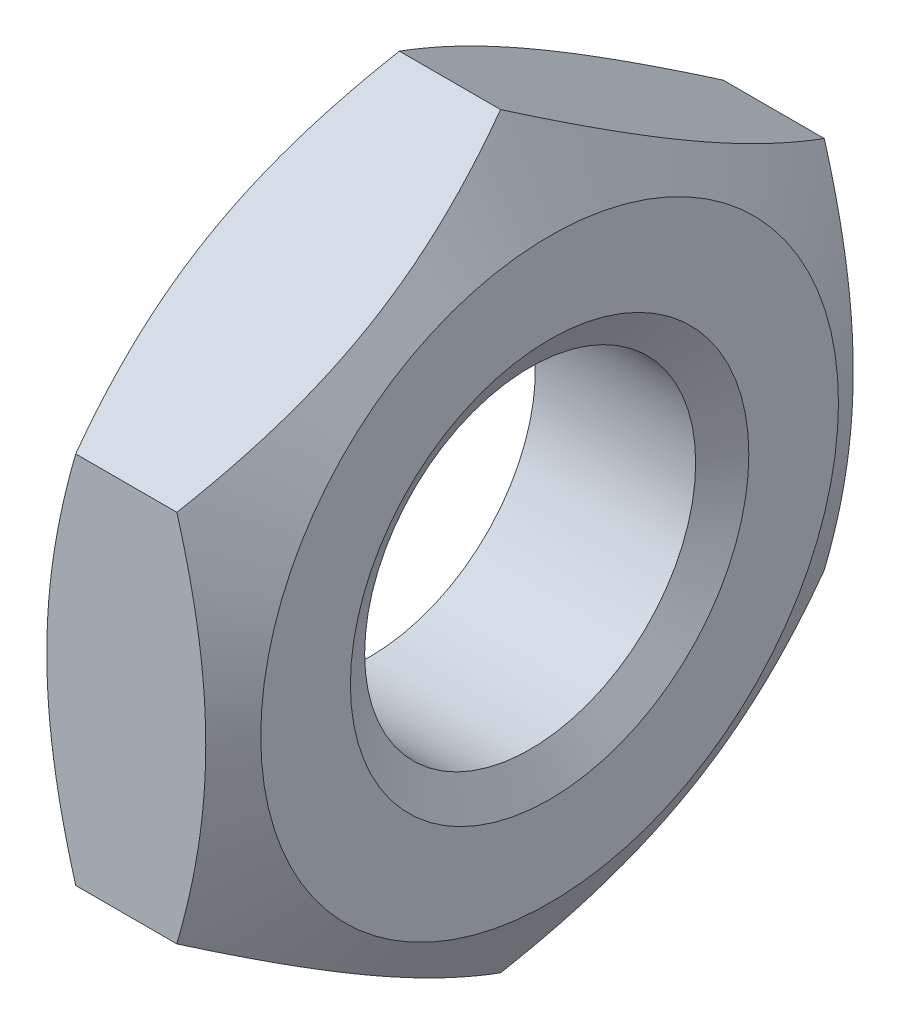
ISO-10303-21;
HEADER;
FILE_DESCRIPTION(('STEP AP214'),'2;1');
FILE_NAME('part.step','',(''),(''),'','','');
FILE_SCHEMA(('AUTOMOTIVE_DESIGN { 1 0 10303 214 1 1 1 1 }'));
ENDSEC;
DATA;
#1=APPLICATION_CONTEXT('core data for automotive mechanical design processes');
#2=APPLICATION_PROTOCOL_DEFINITION('international standard','automotive_design',2000,#1);
#3=PRODUCT_CONTEXT('',#1,'mechanical');
#4=PRODUCT('Part','Part','',(#3));
#5=PRODUCT_RELATED_PRODUCT_CATEGORY('part','',(#4));
#6=PRODUCT_DEFINITION_FORMATION('','',#4);
#7=PRODUCT_DEFINITION_CONTEXT('part definition',#1,'design');
#8=PRODUCT_DEFINITION('design','',#6,#7);
#9=PRODUCT_DEFINITION_SHAPE('','',#8);
#10=(LENGTH_UNIT() NAMED_UNIT(*) SI_UNIT(.MILLI.,.METRE.));
#11=(NAMED_UNIT(*) PLANE_ANGLE_UNIT() SI_UNIT($,.RADIAN.));
#12=(NAMED_UNIT(*) SI_UNIT($,.STERADIAN.) SOLID_ANGLE_UNIT());
#13=UNCERTAINTY_MEASURE_WITH_UNIT(LENGTH_MEASURE(1.E-05),#10,'distance_accuracy_value','');
#14=(GEOMETRIC_REPRESENTATION_CONTEXT(3) GLOBAL_UNCERTAINTY_ASSIGNED_CONTEXT((#13)) GLOBAL_UNIT_ASSIGNED_CONTEXT((#10,
#11,#12)) REPRESENTATION_CONTEXT('',''));
#15=CARTESIAN_POINT('',(0.,0.,0.));
#16=DIRECTION('',(0.,0.,1.));
#17=DIRECTION('',(1.,0.,0.));
#18=AXIS2_PLACEMENT_3D('',#15,#16,#17);
#19=CARTESIAN_POINT('',(0.,-3.75277674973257,6.5));
#20=DIRECTION('',(0.,0.,1.));
#21=DIRECTION('',(1.,0.,0.));
#22=AXIS2_PLACEMENT_3D('',#19,#20,#21);
#23=PLANE('',#22);
#24=CARTESIAN_POINT('',(3.01529819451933,3.75277677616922,6.49999996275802));
#25=CARTESIAN_POINT('',(3.06291428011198,3.58779804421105,6.49999998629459));
#26=CARTESIAN_POINT('',(3.10836918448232,3.42220419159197,6.49999999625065));
#27=CARTESIAN_POINT('',(3.19436143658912,3.08967170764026,6.50000000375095));
#28=CARTESIAN_POINT('',(3.2348966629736,2.92273252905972,6.50000000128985));
#29=CARTESIAN_POINT('',(3.3483271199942,2.41924227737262,6.49999999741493));
#30=CARTESIAN_POINT('',(3.41284405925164,2.08070382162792,6.49999999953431));
#31=CARTESIAN_POINT('',(3.48849596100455,1.57408722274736,6.50000000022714));
#32=CARTESIAN_POINT('',(3.51004663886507,1.40752264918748,6.50000000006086));
#33=CARTESIAN_POINT('',(3.54618311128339,1.07364098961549,6.49999999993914));
#34=CARTESIAN_POINT('',(3.56076952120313,0.906323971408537,6.49999999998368));
#35=CARTESIAN_POINT('',(3.58260571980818,0.571399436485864,6.5000000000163));
#36=CARTESIAN_POINT('',(3.58986383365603,0.403792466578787,6.50000000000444));
#37=CARTESIAN_POINT('',(3.59689560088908,0.0684330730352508,6.49999999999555));
#38=CARTESIAN_POINT('',(3.59666948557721,-0.0993193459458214,6.49999999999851));
#39=CARTESIAN_POINT('',(3.58576325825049,-0.558877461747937,6.50000000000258));
#40=CARTESIAN_POINT('',(3.56746378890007,-0.850532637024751,6.50000000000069));
#41=CARTESIAN_POINT('',(3.50944227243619,-1.43190589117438,6.4999999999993));
#42=CARTESIAN_POINT('',(3.46970040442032,-1.72162192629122,6.4999999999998));
#43=CARTESIAN_POINT('',(3.37035972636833,-2.30416466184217,6.5000000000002));
#44=CARTESIAN_POINT('',(3.31034012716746,-2.59691787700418,6.5000000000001));
#45=CARTESIAN_POINT('',(3.17412079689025,-3.1780591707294,6.4999999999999));
#46=CARTESIAN_POINT('',(3.09795305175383,-3.46645468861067,6.49999999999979));
#47=CARTESIAN_POINT('',(3.01529825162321,-3.75277666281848,6.5));
#48=B_SPLINE_CURVE_WITH_KNOTS('',3,(#24,#25,#26,#27,#28,#29,#30,#31,#32,#33,#34,#35,#36,#37,#38,
#39,#40,#41,#42,#43,#44,#45,#46,#47),.UNSPECIFIED.,.F.,.F.,(4,2,2,2,2,2,2,2,2,2,2,4),(0.,
0.515097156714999,1.03041563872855,2.06319351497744,2.56693471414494,3.07063139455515,
3.57375521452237,4.07686348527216,4.95263086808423,5.82920918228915,6.72522580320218,
7.61948392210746),.UNSPECIFIED.);
#49=CARTESIAN_POINT('',(3.01529823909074,3.75277677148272,6.49999996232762));
#50=VERTEX_POINT('',#49);
#51=CARTESIAN_POINT('',(3.01529823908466,-3.75277670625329,6.5));
#52=VERTEX_POINT('',#51);
#53=EDGE_CURVE('E92',#50,#52,#48,.T.);
#54=ORIENTED_EDGE('',*,*,#53,.F.);
#55=DIRECTION('',(1.,0.,0.));
#56=VECTOR('',#55,1.);
#57=CARTESIAN_POINT('',(0.,3.75277674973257,6.5));
#58=LINE('',#57,#56);
#59=CARTESIAN_POINT('',(0.984701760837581,3.75277670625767,6.5));
#60=VERTEX_POINT('',#59);
#61=EDGE_CURVE('E80',#60,#50,#58,.T.);
#62=ORIENTED_EDGE('',*,*,#61,.F.);
#63=CARTESIAN_POINT('',(0.984701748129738,-3.75277666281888,6.50000000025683));
#64=CARTESIAN_POINT('',(0.937085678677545,-3.58779792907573,6.50000000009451));
#65=CARTESIAN_POINT('',(0.891630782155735,-3.42220407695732,6.50000000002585));
#66=CARTESIAN_POINT('',(0.805638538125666,-3.08967159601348,6.49999999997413));
#67=CARTESIAN_POINT('',(0.765103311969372,-2.92273241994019,6.4999999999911));
#68=CARTESIAN_POINT('',(0.651672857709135,-2.41924217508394,6.50000000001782));
#69=CARTESIAN_POINT('',(0.587155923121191,-2.08070372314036,6.50000000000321));
#70=CARTESIAN_POINT('',(0.511504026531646,-1.57408713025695,6.49999999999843));
#71=CARTESIAN_POINT('',(0.489953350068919,-1.40752255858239,6.49999999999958));
#72=CARTESIAN_POINT('',(0.453816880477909,-1.07364090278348,6.50000000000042));
#73=CARTESIAN_POINT('',(0.439230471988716,-0.906323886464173,6.50000000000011));
#74=CARTESIAN_POINT('',(0.41739427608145,-0.57139935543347,6.49999999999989));
#75=CARTESIAN_POINT('',(0.410136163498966,-0.40379238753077,6.49999999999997));
#76=CARTESIAN_POINT('',(0.403104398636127,-0.068432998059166,6.50000000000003));
#77=CARTESIAN_POINT('',(0.403330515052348,0.0993194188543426,6.50000000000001));
#78=CARTESIAN_POINT('',(0.414236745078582,0.558877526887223,6.49999999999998));
#79=CARTESIAN_POINT('',(0.432536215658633,0.850532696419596,6.49999999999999));
#80=CARTESIAN_POINT('',(0.490557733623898,1.43190593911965,6.5));
#81=CARTESIAN_POINT('',(0.530299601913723,1.72162196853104,6.5));
#82=CARTESIAN_POINT('',(0.629640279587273,2.30416469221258,6.5));
#83=CARTESIAN_POINT('',(0.689659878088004,2.59691790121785,6.5));
#84=CARTESIAN_POINT('',(0.825879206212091,3.17805918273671,6.5));
#85=CARTESIAN_POINT('',(0.902046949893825,3.4664546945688,6.5));
#86=CARTESIAN_POINT('',(0.984701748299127,3.75277666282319,6.5));
#87=B_SPLINE_CURVE_WITH_KNOTS('',3,(#63,#64,#65,#66,#67,#68,#69,#70,#71,#72,#73,#74,#75,#76,#77,
#78,#79,#80,#81,#82,#83,#84,#85,#86),.UNSPECIFIED.,.F.,.F.,(4,2,2,2,2,2,2,2,2,2,2,4),(0.,
0.515097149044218,1.03041562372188,2.06319348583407,2.56693467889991,3.07063135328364,
3.57375516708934,4.0768634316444,4.95263079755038,5.82920909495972,6.72522569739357,
7.61948379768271),.UNSPECIFIED.);
#88=CARTESIAN_POINT('',(0.984701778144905,-3.75277674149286,6.5000000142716));
#89=VERTEX_POINT('',#88);
#90=EDGE_CURVE('E116',#89,#60,#87,.T.);
#91=ORIENTED_EDGE('',*,*,#90,.F.);
#92=DIRECTION('',(1.,0.,0.));
#93=VECTOR('',#92,1.);
#94=CARTESIAN_POINT('',(0.,-3.75277674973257,6.5));
#95=LINE('',#94,#93);
#96=EDGE_CURVE('E95',#52,#89,#95,.F.);
#97=ORIENTED_EDGE('',*,*,#96,.F.);
#98=EDGE_LOOP('',(#54,#62,#91,#97));
#99=FACE_BOUND('',#98,.T.);
#100=ADVANCED_FACE('F16',(#99),#23,.T.);
#101=CARTESIAN_POINT('',(0.,3.75277674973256,6.5));
#102=DIRECTION('',(0.,0.866025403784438,0.500000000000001));
#103=DIRECTION('',(0.,-0.500000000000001,0.866025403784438));
#104=AXIS2_PLACEMENT_3D('',#101,#102,#103);
#105=PLANE('',#104);
#106=CARTESIAN_POINT('',(3.01529825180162,7.50555345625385,7.5398923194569E-08));
#107=CARTESIAN_POINT('',(3.06291432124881,7.42306408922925,0.142875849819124));
#108=CARTESIAN_POINT('',(3.10836921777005,7.3402671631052,0.286284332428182));
#109=CARTESIAN_POINT('',(3.1943614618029,7.17400092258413,0.574265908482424));
#110=CARTESIAN_POINT('',(3.23489668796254,7.0905313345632,0.718839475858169));
#111=CARTESIAN_POINT('',(3.34832714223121,6.8387862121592,1.15487481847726));
#112=CARTESIAN_POINT('',(3.41284407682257,6.66951698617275,1.44805771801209));
#113=CARTESIAN_POINT('',(3.48849597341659,6.41620868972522,1.8868005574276));
#114=CARTESIAN_POINT('',(3.51004664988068,6.33292640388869,2.03104970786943));
#115=CARTESIAN_POINT('',(3.54618311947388,6.1659855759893,2.32019970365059));
#116=CARTESIAN_POINT('',(3.56076952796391,6.08232706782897,2.46510049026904));
#117=CARTESIAN_POINT('',(3.58260572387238,5.91486480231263,2.75515364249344));
#118=CARTESIAN_POINT('',(3.58986383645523,5.83106131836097,2.90030553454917));
#119=CARTESIAN_POINT('',(3.59689560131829,5.66338162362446,3.19073528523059));
#120=CARTESIAN_POINT('',(3.59666948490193,5.57950541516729,3.33601313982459));
#121=CARTESIAN_POINT('',(3.58576325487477,5.3497263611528,3.73400213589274));
#122=CARTESIAN_POINT('',(3.56746378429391,5.20389877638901,3.98658292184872));
#123=CARTESIAN_POINT('',(3.50944226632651,4.9132121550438,4.49006691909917));
#124=CARTESIAN_POINT('',(3.46970039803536,4.76835414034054,4.74096836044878));
#125=CARTESIAN_POINT('',(3.37035972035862,4.47708277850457,5.24546515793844));
#126=CARTESIAN_POINT('',(3.31034012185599,4.33070617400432,5.4989968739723));
#127=CARTESIAN_POINT('',(3.17412079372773,4.04013553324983,6.00227998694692));
#128=CARTESIAN_POINT('',(3.09795305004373,3.89593777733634,6.25203782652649));
#129=CARTESIAN_POINT('',(3.01529825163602,3.75277679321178,6.49999992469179));
#130=B_SPLINE_CURVE_WITH_KNOTS('',3,(#106,#107,#108,#109,#110,#111,#112,#113,#114,#115,#116,
#117,#118,#119,#120,#121,#122,#123,#124,#125,#126,#127,#128,#129),.UNSPECIFIED.,.F.,.F.,(4,2,2,
2,2,2,2,2,2,2,2,4),(0.,0.515097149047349,1.03041562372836,2.06319348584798,2.56693467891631,
3.07063135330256,3.57375516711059,4.07686343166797,4.95263079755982,5.82920909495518,
6.72522569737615,7.61948379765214),.UNSPECIFIED.);
#131=CARTESIAN_POINT('',(3.01529822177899,7.50555350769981,1.42628728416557E-08));
#132=VERTEX_POINT('',#131);
#133=EDGE_CURVE('E20',#132,#50,#130,.T.);
#134=ORIENTED_EDGE('',*,*,#133,.F.);
#135=DIRECTION('',(1.,0.,0.));
#136=VECTOR('',#135,1.);
#137=CARTESIAN_POINT('',(0.,7.50555349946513,0.));
#138=LINE('',#137,#136);
#139=CARTESIAN_POINT('',(0.984701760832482,7.50555347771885,3.76656758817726E-08));
#140=VERTEX_POINT('',#139);
#141=EDGE_CURVE('E73',#140,#132,#138,.T.);
#142=ORIENTED_EDGE('',*,*,#141,.F.);
#143=CARTESIAN_POINT('',(0.984701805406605,3.75277670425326,6.50000000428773));
#144=CARTESIAN_POINT('',(0.937085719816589,3.83526609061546,6.35712424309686));
#145=CARTESIAN_POINT('',(0.891630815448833,3.9180630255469,6.21371576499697));
#146=CARTESIAN_POINT('',(0.805638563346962,4.08432927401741,5.92573419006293));
#147=CARTESIAN_POINT('',(0.765103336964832,4.16779886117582,5.78116061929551));
#148=CARTESIAN_POINT('',(0.651672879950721,4.41954398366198,5.34512526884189));
#149=CARTESIAN_POINT('',(0.587155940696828,4.58881321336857,5.05194236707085));
#150=CARTESIAN_POINT('',(0.511504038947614,4.84212151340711,4.61319952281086));
#151=CARTESIAN_POINT('',(0.489953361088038,4.92540380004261,4.46895037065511));
#152=CARTESIAN_POINT('',(0.453816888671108,5.09234462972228,4.17980037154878));
#153=CARTESIAN_POINT('',(0.439230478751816,5.17600313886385,4.03489958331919));
#154=CARTESIAN_POINT('',(0.417394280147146,5.34346540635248,3.74484642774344));
#155=CARTESIAN_POINT('',(0.410136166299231,5.42726889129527,3.59969453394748));
#156=CARTESIAN_POINT('',(0.403104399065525,5.59494858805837,3.30926477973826));
#157=CARTESIAN_POINT('',(0.403330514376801,5.67882479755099,3.16398692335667));
#158=CARTESIAN_POINT('',(0.414236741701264,5.9086038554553,2.76599792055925));
#159=CARTESIAN_POINT('',(0.43253621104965,6.05443144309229,2.51341712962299));
#160=CARTESIAN_POINT('',(0.490557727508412,6.34511807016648,2.00993312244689));
#161=CARTESIAN_POINT('',(0.530299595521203,6.48997608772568,1.75903167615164));
#162=CARTESIAN_POINT('',(0.629640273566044,6.78124745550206,1.25453486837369));
#163=CARTESIAN_POINT('',(0.689659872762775,6.92762406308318,1.0010031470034));
#164=CARTESIAN_POINT('',(0.825879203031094,7.21819470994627,0.497720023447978));
#165=CARTESIAN_POINT('',(0.902046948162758,7.36239246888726,0.247962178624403));
#166=CARTESIAN_POINT('',(0.984701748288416,7.50555345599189,7.52978797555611E-08));
#167=B_SPLINE_CURVE_WITH_KNOTS('',3,(#143,#144,#145,#146,#147,#148,#149,#150,#151,#152,#153,
#154,#155,#156,#157,#158,#159,#160,#161,#162,#163,#164,#165,#166),.UNSPECIFIED.,.F.,.F.,(4,2,2,
2,2,2,2,2,2,2,2,4),(0.,0.515097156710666,1.03041563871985,2.06319351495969,2.56693471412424,
3.07063139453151,3.57375521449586,4.07686348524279,4.95263086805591,5.82920918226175,
6.72522580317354,7.61948392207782),.UNSPECIFIED.);
#168=EDGE_CURVE('E83',#60,#140,#167,.T.);
#169=ORIENTED_EDGE('',*,*,#168,.F.);
#170=ORIENTED_EDGE('',*,*,#61,.T.);
#171=EDGE_LOOP('',(#134,#142,#169,#170));
#172=FACE_BOUND('',#171,.T.);
#173=ADVANCED_FACE('F82',(#172),#105,.T.);
#174=CARTESIAN_POINT('',(0.,7.50555349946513,0.));
#175=DIRECTION('',(0.,0.866025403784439,-0.499999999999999));
#176=DIRECTION('',(0.,0.499999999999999,0.866025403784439));
#177=AXIS2_PLACEMENT_3D('',#174,#175,#176);
#178=PLANE('',#177);
#179=CARTESIAN_POINT('',(3.01529819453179,3.75277670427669,-6.50000000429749));
#180=CARTESIAN_POINT('',(3.06291428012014,3.83526609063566,-6.3571242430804));
#181=CARTESIAN_POINT('',(3.10836918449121,3.91806302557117,-6.21371576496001));
#182=CARTESIAN_POINT('',(3.1943614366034,4.08432927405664,-5.92573418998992));
#183=CARTESIAN_POINT('',(3.23489666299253,4.16779886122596,-5.78116061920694));
#184=CARTESIAN_POINT('',(3.34832712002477,4.41954398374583,-5.34512526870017));
#185=CARTESIAN_POINT('',(3.41284405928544,4.58881321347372,-5.05194236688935));
#186=CARTESIAN_POINT('',(3.48849596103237,4.84212151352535,-4.61319952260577));
#187=CARTESIAN_POINT('',(3.5100466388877,4.92540380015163,-4.46895037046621));
#188=CARTESIAN_POINT('',(3.54618311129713,5.09234462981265,-4.17980037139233));
#189=CARTESIAN_POINT('',(3.56076952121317,5.17600313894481,-4.03489958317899));
#190=CARTESIAN_POINT('',(3.5826057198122,5.34346540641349,-3.74484642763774));
#191=CARTESIAN_POINT('',(3.58986383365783,5.42726889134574,-3.59969453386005));
#192=CARTESIAN_POINT('',(3.59689560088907,5.59494858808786,-3.30926477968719));
#193=CARTESIAN_POINT('',(3.59666948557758,5.67882479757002,-3.16398692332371));
#194=CARTESIAN_POINT('',(3.58576325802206,5.90860386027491,-2.76599791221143));
#195=CARTESIAN_POINT('',(3.56746378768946,6.05443145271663,-2.51341711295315));
#196=CARTESIAN_POINT('',(3.50944226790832,6.34511808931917,-2.00993308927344));
#197=CARTESIAN_POINT('',(3.46970039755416,6.48997611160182,-1.75903163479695));
#198=CARTESIAN_POINT('',(3.37035971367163,6.78124748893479,-1.25453481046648));
#199=CARTESIAN_POINT('',(3.3103401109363,6.92762410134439,-1.00100308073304));
#200=CARTESIAN_POINT('',(3.1741207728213,7.21819475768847,-0.497719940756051));
#201=CARTESIAN_POINT('',(3.09795302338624,7.36239252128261,-0.247962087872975));
#202=CARTESIAN_POINT('',(3.01529821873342,7.50555351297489,2.33995777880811E-08));
#203=B_SPLINE_CURVE_WITH_KNOTS('',3,(#179,#180,#181,#182,#183,#184,#185,#186,#187,#188,#189,
#190,#191,#192,#193,#194,#195,#196,#197,#198,#199,#200,#201,#202),.UNSPECIFIED.,.F.,.F.,(4,2,2,
2,2,2,2,2,2,2,2,4),(0.,0.515097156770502,1.03041563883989,2.06319351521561,2.56693471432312,
3.07063139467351,3.57375521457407,4.07686348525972,4.95263089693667,5.82920924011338,
6.7252258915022,7.61948404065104),.UNSPECIFIED.);
#204=CARTESIAN_POINT('',(3.01529823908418,3.75277670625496,-6.5));
#205=VERTEX_POINT('',#204);
#206=EDGE_CURVE('E94',#205,#132,#203,.T.);
#207=ORIENTED_EDGE('',*,*,#206,.F.);
#208=DIRECTION('',(-1.,0.,0.));
#209=VECTOR('',#208,1.);
#210=CARTESIAN_POINT('',(0.,3.75277674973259,-6.5));
#211=LINE('',#210,#209);
#212=CARTESIAN_POINT('',(0.98470176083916,3.75277677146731,-6.49999996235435));
#213=VERTEX_POINT('',#212);
#214=EDGE_CURVE('E189',#213,#205,#211,.F.);
#215=ORIENTED_EDGE('',*,*,#214,.F.);
#216=CARTESIAN_POINT('',(0.984701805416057,7.50555348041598,4.15297828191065E-08));
#217=CARTESIAN_POINT('',(0.937085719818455,7.42306413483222,-0.142875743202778));
#218=CARTESIAN_POINT('',(0.891630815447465,7.34026721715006,-0.28628423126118));
#219=CARTESIAN_POINT('',(0.805638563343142,7.1740009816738,-0.574265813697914));
#220=CARTESIAN_POINT('',(0.765103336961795,7.09053139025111,-0.718839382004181));
#221=CARTESIAN_POINT('',(0.651672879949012,6.83878626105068,-1.15487472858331));
#222=CARTESIAN_POINT('',(0.587155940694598,6.66951703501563,-1.44805763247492));
#223=CARTESIAN_POINT('',(0.511504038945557,6.41620873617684,-1.88680047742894));
#224=CARTESIAN_POINT('',(0.489953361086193,6.33292644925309,-2.03104962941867));
#225=CARTESIAN_POINT('',(0.45381688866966,6.16598561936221,-2.32019962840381));
#226=CARTESIAN_POINT('',(0.439230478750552,6.08232711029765,-2.46510041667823));
#227=CARTESIAN_POINT('',(0.4173942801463,5.91486484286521,-2.75515357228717));
#228=CARTESIAN_POINT('',(0.410136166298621,5.83106135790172,-2.90030546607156));
#229=CARTESIAN_POINT('',(0.403104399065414,5.66338166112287,-3.19073522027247));
#230=CARTESIAN_POINT('',(0.403330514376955,5.57950545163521,-3.33601307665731));
#231=CARTESIAN_POINT('',(0.414236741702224,5.34972639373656,-3.73400207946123));
#232=CARTESIAN_POINT('',(0.432536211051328,5.20389880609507,-3.98658287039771));
#233=CARTESIAN_POINT('',(0.490557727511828,4.91321217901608,-4.49006687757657));
#234=CARTESIAN_POINT('',(0.530299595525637,4.76835416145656,-4.74096832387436));
#235=CARTESIAN_POINT('',(0.629640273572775,4.47708279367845,-5.24546513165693));
#236=CARTESIAN_POINT('',(0.689659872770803,4.3307061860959,-5.49899685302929));
#237=CARTESIAN_POINT('',(0.825879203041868,4.04013553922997,-6.00227997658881));
#238=CARTESIAN_POINT('',(0.902046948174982,3.89593778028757,-6.25203782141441));
#239=CARTESIAN_POINT('',(0.98470174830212,3.75277679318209,-6.49999992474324));
#240=B_SPLINE_CURVE_WITH_KNOTS('',3,(#216,#217,#218,#219,#220,#221,#222,#223,#224,#225,#226,
#227,#228,#229,#230,#231,#232,#233,#234,#235,#236,#237,#238,#239),.UNSPECIFIED.,.F.,.F.,(4,2,2,
2,2,2,2,2,2,2,2,4),(0.,0.515097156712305,1.03041563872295,2.06319351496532,2.5669347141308,
3.07063139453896,3.57375521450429,4.07686348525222,4.95263086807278,5.829209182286,
6.72522580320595,7.61948392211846),.UNSPECIFIED.);
#241=EDGE_CURVE('E159',#140,#213,#240,.T.);
#242=ORIENTED_EDGE('',*,*,#241,.F.);
#243=ORIENTED_EDGE('',*,*,#141,.T.);
#244=EDGE_LOOP('',(#207,#215,#242,#243));
#245=FACE_BOUND('',#244,.T.);
#246=ADVANCED_FACE('F163',(#245),#178,.T.);
#247=CARTESIAN_POINT('',(0.,3.75277674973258,-6.5));
#248=DIRECTION('',(0.,0.,-1.));
#249=DIRECTION('',(-1.,0.,0.));
#250=AXIS2_PLACEMENT_3D('',#247,#248,#249);
#251=PLANE('',#250);
#252=CARTESIAN_POINT('',(3.01529819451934,-3.7527767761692,-6.49999996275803));
#253=CARTESIAN_POINT('',(3.06291428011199,-3.58779804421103,-6.4999999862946));
#254=CARTESIAN_POINT('',(3.10836918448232,-3.42220419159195,-6.49999999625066));
#255=CARTESIAN_POINT('',(3.19436143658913,-3.08967170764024,-6.50000000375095));
#256=CARTESIAN_POINT('',(3.23489666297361,-2.92273252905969,-6.50000000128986));
#257=CARTESIAN_POINT('',(3.34832711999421,-2.4192422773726,-6.49999999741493));
#258=CARTESIAN_POINT('',(3.41284405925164,-2.0807038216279,-6.49999999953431));
#259=CARTESIAN_POINT('',(3.48849596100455,-1.57408722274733,-6.50000000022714));
#260=CARTESIAN_POINT('',(3.51004663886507,-1.40752264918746,-6.50000000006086));
#261=CARTESIAN_POINT('',(3.54618311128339,-1.07364098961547,-6.49999999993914));
#262=CARTESIAN_POINT('',(3.56076952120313,-0.906323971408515,-6.49999999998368));
#263=CARTESIAN_POINT('',(3.58260571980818,-0.571399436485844,-6.5000000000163));
#264=CARTESIAN_POINT('',(3.58986383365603,-0.403792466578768,-6.50000000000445));
#265=CARTESIAN_POINT('',(3.59689560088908,-0.0684330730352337,-6.49999999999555));
#266=CARTESIAN_POINT('',(3.59666948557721,0.0993193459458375,-6.49999999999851));
#267=CARTESIAN_POINT('',(3.58576325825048,0.558877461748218,-6.50000000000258));
#268=CARTESIAN_POINT('',(3.56746378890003,0.850532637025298,-6.5000000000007));
#269=CARTESIAN_POINT('',(3.50944227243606,1.43190589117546,-6.4999999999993));
#270=CARTESIAN_POINT('',(3.46970040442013,1.72162192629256,-6.4999999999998));
#271=CARTESIAN_POINT('',(3.37035972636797,2.30416466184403,-6.5000000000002));
#272=CARTESIAN_POINT('',(3.31034012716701,2.59691787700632,-6.5000000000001));
#273=CARTESIAN_POINT('',(3.17412079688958,3.17805917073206,-6.4999999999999));
#274=CARTESIAN_POINT('',(3.09795305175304,3.46645468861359,-6.49999999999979));
#275=CARTESIAN_POINT('',(3.0152982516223,3.75277666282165,-6.5));
#276=B_SPLINE_CURVE_WITH_KNOTS('',3,(#252,#253,#254,#255,#256,#257,#258,#259,#260,#261,#262,
#263,#264,#265,#266,#267,#268,#269,#270,#271,#272,#273,#274,#275),.UNSPECIFIED.,.F.,.F.,(4,2,2,
2,2,2,2,2,2,2,2,4),(0.,0.515097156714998,1.03041563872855,2.06319351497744,2.56693471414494,
3.07063139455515,3.57375521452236,4.07686348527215,4.95263086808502,5.82920918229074,
6.72522580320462,7.61948392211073),.UNSPECIFIED.);
#277=CARTESIAN_POINT('',(3.01529823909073,-3.7527767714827,-6.49999996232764));
#278=VERTEX_POINT('',#277);
#279=EDGE_CURVE('E174',#278,#205,#276,.T.);
#280=ORIENTED_EDGE('',*,*,#279,.F.);
#281=DIRECTION('',(1.,0.,0.));
#282=VECTOR('',#281,1.);
#283=CARTESIAN_POINT('',(0.,-3.75277674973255,-6.50000000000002));
#284=LINE('',#283,#282);
#285=CARTESIAN_POINT('',(0.984701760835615,-3.75277670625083,-6.50000000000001));
#286=VERTEX_POINT('',#285);
#287=EDGE_CURVE('E187',#286,#278,#284,.T.);
#288=ORIENTED_EDGE('',*,*,#287,.F.);
#289=CARTESIAN_POINT('',(0.984701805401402,3.7527767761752,-6.49999996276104));
#290=CARTESIAN_POINT('',(0.937085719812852,3.58779804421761,-6.4999999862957));
#291=CARTESIAN_POINT('',(0.891630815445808,3.42220419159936,-6.49999999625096));
#292=CARTESIAN_POINT('',(0.805638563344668,3.08967170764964,-6.50000000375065));
#293=CARTESIAN_POINT('',(0.765103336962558,2.92273252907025,-6.50000000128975));
#294=CARTESIAN_POINT('',(0.651672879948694,2.41924227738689,-6.49999999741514));
#295=CARTESIAN_POINT('',(0.587155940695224,2.08070382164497,-6.49999999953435));
#296=CARTESIAN_POINT('',(0.51150403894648,1.57408722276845,-6.50000000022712));
#297=CARTESIAN_POINT('',(0.489953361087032,1.40752264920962,-6.50000000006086));
#298=CARTESIAN_POINT('',(0.45381688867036,1.07364098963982,-6.49999999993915));
#299=CARTESIAN_POINT('',(0.439230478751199,0.90632397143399,-6.49999999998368));
#300=CARTESIAN_POINT('',(0.417394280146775,0.571399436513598,-6.5000000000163));
#301=CARTESIAN_POINT('',(0.410136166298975,0.403792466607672,-6.50000000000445));
#302=CARTESIAN_POINT('',(0.403104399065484,0.0684330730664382,-6.49999999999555));
#303=CARTESIAN_POINT('',(0.403330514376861,-0.099319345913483,-6.49999999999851));
#304=CARTESIAN_POINT('',(0.414236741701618,-0.558877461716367,-6.50000000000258));
#305=CARTESIAN_POINT('',(0.432536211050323,-0.850532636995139,-6.5000000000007));
#306=CARTESIAN_POINT('',(0.490557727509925,-1.43190589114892,-6.4999999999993));
#307=CARTESIAN_POINT('',(0.530299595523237,-1.72162192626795,-6.4999999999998));
#308=CARTESIAN_POINT('',(0.629640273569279,-2.30416466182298,-6.5000000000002));
#309=CARTESIAN_POINT('',(0.689659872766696,-2.59691787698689,-6.5000000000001));
#310=CARTESIAN_POINT('',(0.82587920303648,-3.17805917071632,-6.4999999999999));
#311=CARTESIAN_POINT('',(0.902046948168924,-3.46645468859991,-6.49999999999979));
#312=CARTESIAN_POINT('',(0.984701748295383,-3.75277666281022,-6.5));
#313=B_SPLINE_CURVE_WITH_KNOTS('',3,(#289,#290,#291,#292,#293,#294,#295,#296,#297,#298,#299,
#300,#301,#302,#303,#304,#305,#306,#307,#308,#309,#310,#311,#312),.UNSPECIFIED.,.F.,.F.,(4,2,2,
2,2,2,2,2,2,2,2,4),(0.,0.515097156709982,1.03041563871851,2.0631935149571,2.56693471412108,
3.07063139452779,3.57375521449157,4.07686348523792,4.95263086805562,5.82920918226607,
6.72522580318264,7.61948392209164),.UNSPECIFIED.);
#314=EDGE_CURVE('E154',#213,#286,#313,.T.);
#315=ORIENTED_EDGE('',*,*,#314,.F.);
#316=ORIENTED_EDGE('',*,*,#214,.T.);
#317=EDGE_LOOP('',(#280,#288,#315,#316));
#318=FACE_BOUND('',#317,.T.);
#319=ADVANCED_FACE('F166',(#318),#251,.T.);
#320=CARTESIAN_POINT('',(0.,-3.75277674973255,-6.50000000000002));
#321=DIRECTION('',(0.,-0.866025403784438,-0.500000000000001));
#322=DIRECTION('',(0.,0.500000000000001,-0.866025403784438));
#323=AXIS2_PLACEMENT_3D('',#320,#321,#322);
#324=PLANE('',#323);
#325=CARTESIAN_POINT('',(3.01529819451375,-7.50555348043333,4.15271976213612E-08));
#326=CARTESIAN_POINT('',(3.06291428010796,-7.4230641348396,-0.142875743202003));
#327=CARTESIAN_POINT('',(3.10836918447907,-7.34026721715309,-0.28628423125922));
#328=CARTESIAN_POINT('',(3.19436143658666,-7.17400098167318,-0.574265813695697));
#329=CARTESIAN_POINT('',(3.23489666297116,-7.0905313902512,-0.718839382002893));
#330=CARTESIAN_POINT('',(3.34832711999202,-6.83878626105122,-1.15487472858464));
#331=CARTESIAN_POINT('',(3.41284405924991,-6.66951703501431,-1.44805763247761));
#332=CARTESIAN_POINT('',(3.48849596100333,-6.41620873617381,-1.88680047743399));
#333=CARTESIAN_POINT('',(3.51004663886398,-6.33292644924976,-2.03104962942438));
#334=CARTESIAN_POINT('',(3.54618311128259,-6.16598561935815,-2.3201996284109));
#335=CARTESIAN_POINT('',(3.56076952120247,-6.08232711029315,-2.46510041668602));
#336=CARTESIAN_POINT('',(3.58260571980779,-5.91486484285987,-2.7551535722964));
#337=CARTESIAN_POINT('',(3.58986383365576,-5.83106135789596,-2.90030546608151));
#338=CARTESIAN_POINT('',(3.59689560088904,-5.66338166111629,-3.19073522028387));
#339=CARTESIAN_POINT('',(3.59666948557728,-5.57950545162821,-3.33601307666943));
#340=CARTESIAN_POINT('',(3.58576325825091,-5.34972639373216,-3.73400207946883));
#341=CARTESIAN_POINT('',(3.56746378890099,-5.20389880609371,-3.98658287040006));
#342=CARTESIAN_POINT('',(3.50944227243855,-4.91321217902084,-4.49006687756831));
#343=CARTESIAN_POINT('',(3.46970040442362,-4.7683541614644,-4.74096832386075));
#344=CARTESIAN_POINT('',(3.37035972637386,-4.47708279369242,-5.24546513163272));
#345=CARTESIAN_POINT('',(3.3103401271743,-4.3307061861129,-5.49899685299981));
#346=CARTESIAN_POINT('',(3.17412079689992,-4.04013553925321,-6.00227997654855));
#347=CARTESIAN_POINT('',(3.09795305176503,-3.895937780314,-6.25203782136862));
#348=CARTESIAN_POINT('',(3.01529825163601,-3.75277679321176,-6.49999992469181));
#349=B_SPLINE_CURVE_WITH_KNOTS('',3,(#325,#326,#327,#328,#329,#330,#331,#332,#333,#334,#335,
#336,#337,#338,#339,#340,#341,#342,#343,#344,#345,#346,#347,#348),.UNSPECIFIED.,.F.,.F.,(4,2,2,
2,2,2,2,2,2,2,2,4),(0.,0.515097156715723,1.03041563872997,2.06319351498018,2.5669347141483,
3.07063139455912,3.57375521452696,4.07686348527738,4.95263086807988,5.82920918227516,
6.72522580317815,7.61948392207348),.UNSPECIFIED.);
#350=CARTESIAN_POINT('',(3.01529823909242,-7.50555347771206,3.76774358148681E-08));
#351=VERTEX_POINT('',#350);
#352=EDGE_CURVE('E98',#351,#278,#349,.T.);
#353=ORIENTED_EDGE('',*,*,#352,.F.);
#354=DIRECTION('',(1.,0.,0.));
#355=VECTOR('',#354,1.);
#356=CARTESIAN_POINT('',(0.,-7.50555349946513,0.));
#357=LINE('',#356,#355);
#358=CARTESIAN_POINT('',(0.984701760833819,-7.50555347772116,-3.7661659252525E-08));
#359=VERTEX_POINT('',#358);
#360=EDGE_CURVE('E191',#359,#351,#357,.T.);
#361=ORIENTED_EDGE('',*,*,#360,.F.);
#362=CARTESIAN_POINT('',(0.984701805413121,-3.75277670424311,-6.50000000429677));
#363=CARTESIAN_POINT('',(0.937085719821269,-3.83526609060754,-6.35712424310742));
#364=CARTESIAN_POINT('',(0.89163081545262,-3.91806302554,-6.21371576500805));
#365=CARTESIAN_POINT('',(0.805638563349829,-4.08432927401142,-5.92573419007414));
#366=CARTESIAN_POINT('',(0.765103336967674,-4.16779886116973,-5.78116061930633));
#367=CARTESIAN_POINT('',(0.651672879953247,-4.4195439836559,-5.34512526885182));
#368=CARTESIAN_POINT('',(0.587155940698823,-4.58881321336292,-5.05194236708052));
#369=CARTESIAN_POINT('',(0.511504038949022,-4.84212151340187,-4.61319952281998));
#370=CARTESIAN_POINT('',(0.489953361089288,-4.92540380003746,-4.46895037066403));
#371=CARTESIAN_POINT('',(0.453816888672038,-5.09234462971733,-4.17980037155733));
#372=CARTESIAN_POINT('',(0.439230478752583,-5.17600313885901,-4.03489958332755));
#373=CARTESIAN_POINT('',(0.417394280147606,-5.34346540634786,-3.74484642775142));
#374=CARTESIAN_POINT('',(0.410136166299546,-5.42726889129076,-3.59969453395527));
#375=CARTESIAN_POINT('',(0.40310439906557,-5.5949485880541,-3.30926477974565));
#376=CARTESIAN_POINT('',(0.403330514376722,-5.67882479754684,-3.16398692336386));
#377=CARTESIAN_POINT('',(0.414236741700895,-5.90860385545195,-2.76599792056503));
#378=CARTESIAN_POINT('',(0.432536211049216,-6.05443144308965,-2.51341712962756));
#379=CARTESIAN_POINT('',(0.490557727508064,-6.34511807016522,-2.00993312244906));
#380=CARTESIAN_POINT('',(0.530299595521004,-6.48997608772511,-1.75903167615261));
#381=CARTESIAN_POINT('',(0.629640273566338,-6.78124745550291,-1.2545348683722));
#382=CARTESIAN_POINT('',(0.689659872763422,-6.92762406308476,-1.00100314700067));
#383=CARTESIAN_POINT('',(0.825879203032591,-7.21819470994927,-0.497720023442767));
#384=CARTESIAN_POINT('',(0.902046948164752,-7.36239246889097,-0.247962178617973));
#385=CARTESIAN_POINT('',(0.984701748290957,-7.50555345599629,-7.52902474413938E-08));
#386=B_SPLINE_CURVE_WITH_KNOTS('',3,(#362,#363,#364,#365,#366,#367,#368,#369,#370,#371,#372,
#373,#374,#375,#376,#377,#378,#379,#380,#381,#382,#383,#384,#385),.UNSPECIFIED.,.F.,.F.,(4,2,2,
2,2,2,2,2,2,2,2,4),(0.,0.515097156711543,1.03041563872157,2.06319351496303,2.56693471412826,
3.07063139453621,3.57375521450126,4.07686348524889,4.95263086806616,5.82920918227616,
6.72522580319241,7.61948392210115),.UNSPECIFIED.);
#387=EDGE_CURVE('E40',#286,#359,#386,.T.);
#388=ORIENTED_EDGE('',*,*,#387,.F.);
#389=ORIENTED_EDGE('',*,*,#287,.T.);
#390=EDGE_LOOP('',(#353,#361,#388,#389));
#391=FACE_BOUND('',#390,.T.);
#392=ADVANCED_FACE('F170',(#391),#324,.T.);
#393=CARTESIAN_POINT('',(0.,-7.50555349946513,0.));
#394=DIRECTION('',(0.,-0.866025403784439,0.5));
#395=DIRECTION('',(0.,-0.5,-0.866025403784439));
#396=AXIS2_PLACEMENT_3D('',#393,#394,#395);
#397=PLANE('',#396);
#398=CARTESIAN_POINT('',(3.0152981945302,-3.75277670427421,6.5000000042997));
#399=CARTESIAN_POINT('',(3.06291428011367,-3.83526609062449,6.35712424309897));
#400=CARTESIAN_POINT('',(3.10836918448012,-3.91806302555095,6.21371576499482));
#401=CARTESIAN_POINT('',(3.194361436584,-4.08432927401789,5.92573419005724));
#402=CARTESIAN_POINT('',(3.23489666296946,-4.16779886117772,5.78116061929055));
#403=CARTESIAN_POINT('',(3.34832711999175,-4.41954398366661,5.34512526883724));
#404=CARTESIAN_POINT('',(3.41284405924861,-4.58881321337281,5.0519423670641));
#405=CARTESIAN_POINT('',(3.48849596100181,-4.84212151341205,4.61319952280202));
#406=CARTESIAN_POINT('',(3.51004663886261,-4.92540380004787,4.46895037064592));
#407=CARTESIAN_POINT('',(3.54618311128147,-5.09234462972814,4.1798003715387));
#408=CARTESIAN_POINT('',(3.56076952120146,-5.17600313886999,4.03489958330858));
#409=CARTESIAN_POINT('',(3.58260571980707,-5.34346540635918,3.74484642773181));
#410=CARTESIAN_POINT('',(3.58986383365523,-5.42726889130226,3.59969453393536));
#411=CARTESIAN_POINT('',(3.59689560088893,-5.59494858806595,3.30926477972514));
#412=CARTESIAN_POINT('',(3.59666948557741,-5.67882479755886,3.16398692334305));
#413=CARTESIAN_POINT('',(3.58576325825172,-5.9086038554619,2.76599792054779));
#414=CARTESIAN_POINT('',(3.56746378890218,-6.05443144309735,2.51341712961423));
#415=CARTESIAN_POINT('',(3.50944227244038,-6.34511807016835,2.00993312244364));
#416=CARTESIAN_POINT('',(3.4697004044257,-6.48997608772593,1.7590316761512));
#417=CARTESIAN_POINT('',(3.37035972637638,-6.78124745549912,1.25453486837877));
#418=CARTESIAN_POINT('',(3.31034012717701,-6.92762406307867,1.00100314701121));
#419=CARTESIAN_POINT('',(3.17412079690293,-7.2181947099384,0.497720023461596));
#420=CARTESIAN_POINT('',(3.09795305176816,-7.36239246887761,0.247962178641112));
#421=CARTESIAN_POINT('',(3.01529825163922,-7.50555345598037,7.53178248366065E-08));
#422=B_SPLINE_CURVE_WITH_KNOTS('',3,(#398,#399,#400,#401,#402,#403,#404,#405,#406,#407,#408,
#409,#410,#411,#412,#413,#414,#415,#416,#417,#418,#419,#420,#421),.UNSPECIFIED.,.F.,.F.,(4,2,2,
2,2,2,2,2,2,2,2,4),(0.,0.515097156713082,1.03041563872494,2.0631935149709,2.56693471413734,
3.07063139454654,3.57375521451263,4.07686348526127,4.95263086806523,5.82920918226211,
6.72522580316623,7.6194839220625),.UNSPECIFIED.);
#423=EDGE_CURVE('E97',#52,#351,#422,.T.);
#424=ORIENTED_EDGE('',*,*,#423,.F.);
#425=ORIENTED_EDGE('',*,*,#96,.T.);
#426=CARTESIAN_POINT('',(0.98470180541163,-7.50555348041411,-4.15207429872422E-08));
#427=CARTESIAN_POINT('',(0.937085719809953,-7.42306413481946,0.142875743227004));
#428=CARTESIAN_POINT('',(0.891630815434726,-7.34026721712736,0.286284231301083));
#429=CARTESIAN_POINT('',(0.805638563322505,-7.17400098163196,0.574265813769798));
#430=CARTESIAN_POINT('',(0.765103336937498,-7.09053139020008,0.718839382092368));
#431=CARTESIAN_POINT('',(0.651672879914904,-6.83878626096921,1.15487472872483));
#432=CARTESIAN_POINT('',(0.587155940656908,-6.66951703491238,1.44805763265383));
#433=CARTESIAN_POINT('',(0.511504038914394,-6.41620873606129,1.88680047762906));
#434=CARTESIAN_POINT('',(0.48995336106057,-6.33292644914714,2.03104962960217));
#435=CARTESIAN_POINT('',(0.453816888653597,-6.1659856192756,2.32019962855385));
#436=CARTESIAN_POINT('',(0.439230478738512,-6.08232711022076,2.4651004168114));
#437=CARTESIAN_POINT('',(0.417394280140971,-5.91486484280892,2.75515357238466));
#438=CARTESIAN_POINT('',(0.410136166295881,-5.8310613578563,2.90030546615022));
#439=CARTESIAN_POINT('',(0.403104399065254,-5.66338166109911,3.19073522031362));
#440=CARTESIAN_POINT('',(0.403330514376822,-5.57950545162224,3.33601307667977));
#441=CARTESIAN_POINT('',(0.414236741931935,-5.34972638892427,3.73400208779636));
#442=CARTESIAN_POINT('',(0.432536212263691,-5.20389879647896,3.98658288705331));
#443=CARTESIAN_POINT('',(0.490557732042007,-4.9132121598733,4.49006691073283));
#444=CARTESIAN_POINT('',(0.530299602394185,-4.76835413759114,4.74096836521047));
#445=CARTESIAN_POINT('',(0.629640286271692,-4.47708276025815,5.24546518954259));
#446=CARTESIAN_POINT('',(0.689659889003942,-4.33070614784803,5.49899691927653));
#447=CARTESIAN_POINT('',(0.825879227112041,-4.04013549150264,6.00228005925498));
#448=CARTESIAN_POINT('',(0.902046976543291,-3.89593772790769,6.25203791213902));
#449=CARTESIAN_POINT('',(0.984701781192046,-3.75277673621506,6.50000002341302));
#450=B_SPLINE_CURVE_WITH_KNOTS('',3,(#426,#427,#428,#429,#430,#431,#432,#433,#434,#435,#436,
#437,#438,#439,#440,#441,#442,#443,#444,#445,#446,#447,#448,#449),.UNSPECIFIED.,.F.,.F.,(4,2,2,
2,2,2,2,2,2,2,2,4),(0.,0.515097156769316,1.03041563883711,2.06319351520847,2.56693471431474,
3.07063139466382,3.57375521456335,4.07686348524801,4.95263089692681,5.82920924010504,
6.72522589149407,7.61948404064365),.UNSPECIFIED.);
#451=EDGE_CURVE('E142',#359,#89,#450,.T.);
#452=ORIENTED_EDGE('',*,*,#451,.F.);
#453=ORIENTED_EDGE('',*,*,#360,.T.);
#454=EDGE_LOOP('',(#424,#425,#452,#453));
#455=FACE_BOUND('',#454,.T.);
#456=ADVANCED_FACE('F210',(#455),#397,.T.);
#457=CARTESIAN_POINT('',(3.0093900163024,0.,0.));
#458=DIRECTION('',(-1.,0.,0.));
#459=DIRECTION('',(0.,0.,1.));
#460=AXIS2_PLACEMENT_3D('',#457,#458,#459);
#461=CONICAL_SURFACE('',#460,7.51578681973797,1.04719754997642);
#462=CARTESIAN_POINT('',(4.00000000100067,0.,0.));
#463=DIRECTION('',(-1.,0.,0.));
#464=DIRECTION('',(0.,0.,1.));
#465=AXIS2_PLACEMENT_3D('',#462,#463,#464);
#466=CIRCLE('',#465,5.80000000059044);
#467=CARTESIAN_POINT('',(4.00000000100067,0.,5.80000000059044));
#468=VERTEX_POINT('',#467);
#469=EDGE_CURVE('E204',#468,#468,#466,.F.);
#470=ORIENTED_EDGE('',*,*,#469,.F.);
#471=EDGE_LOOP('',(#470));
#472=FACE_BOUND('',#471,.T.);
#473=ORIENTED_EDGE('',*,*,#279,.T.);
#474=ORIENTED_EDGE('',*,*,#206,.T.);
#475=ORIENTED_EDGE('',*,*,#133,.T.);
#476=ORIENTED_EDGE('',*,*,#53,.T.);
#477=ORIENTED_EDGE('',*,*,#423,.T.);
#478=ORIENTED_EDGE('',*,*,#352,.T.);
#479=EDGE_LOOP('',(#473,#474,#475,#476,#477,#478));
#480=FACE_BOUND('',#479,.T.);
#481=ADVANCED_FACE('F90',(#472,#480),#461,.T.);
#482=CARTESIAN_POINT('',(0.990609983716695,0.,0.));
#483=DIRECTION('',(1.,0.,0.));
#484=DIRECTION('',(0.,0.,-1.));
#485=AXIS2_PLACEMENT_3D('',#482,#483,#484);
#486=CONICAL_SURFACE('',#485,7.5157868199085,1.04719755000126);
#487=CARTESIAN_POINT('',(-1.02318175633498E-09,0.,0.));
#488=DIRECTION('',(1.,0.,0.));
#489=DIRECTION('',(0.,0.,-1.));
#490=AXIS2_PLACEMENT_3D('',#487,#488,#489);
#491=CIRCLE('',#490,5.80000000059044);
#492=CARTESIAN_POINT('',(-1.02318175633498E-09,0.,-5.80000000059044));
#493=VERTEX_POINT('',#492);
#494=EDGE_CURVE('E202',#493,#493,#491,.T.);
#495=ORIENTED_EDGE('',*,*,#494,.T.);
#496=EDGE_LOOP('',(#495));
#497=FACE_BOUND('',#496,.T.);
#498=ORIENTED_EDGE('',*,*,#387,.T.);
#499=ORIENTED_EDGE('',*,*,#451,.T.);
#500=ORIENTED_EDGE('',*,*,#90,.T.);
#501=ORIENTED_EDGE('',*,*,#168,.T.);
#502=ORIENTED_EDGE('',*,*,#241,.T.);
#503=ORIENTED_EDGE('',*,*,#314,.T.);
#504=EDGE_LOOP('',(#498,#499,#500,#501,#502,#503));
#505=FACE_BOUND('',#504,.T.);
#506=ADVANCED_FACE('F130',(#497,#505),#486,.T.);
#507=CARTESIAN_POINT('',(4.,0.,0.));
#508=DIRECTION('',(1.,0.,0.));
#509=DIRECTION('',(0.,0.,-1.));
#510=AXIS2_PLACEMENT_3D('',#507,#508,#509);
#511=PLANE('',#510);
#512=CARTESIAN_POINT('',(4.00000000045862,0.,0.));
#513=DIRECTION('',(1.,0.,0.));
#514=DIRECTION('',(0.,0.,-1.));
#515=AXIS2_PLACEMENT_3D('',#512,#513,#514);
#516=CIRCLE('',#515,4.00008234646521);
#517=CARTESIAN_POINT('',(4.00000000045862,0.,-4.00008234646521));
#518=VERTEX_POINT('',#517);
#519=EDGE_CURVE('E199',#518,#518,#516,.F.);
#520=ORIENTED_EDGE('',*,*,#519,.T.);
#521=EDGE_LOOP('',(#520));
#522=FACE_BOUND('',#521,.T.);
#523=ORIENTED_EDGE('',*,*,#469,.T.);
#524=EDGE_LOOP('',(#523));
#525=FACE_BOUND('',#524,.T.);
#526=ADVANCED_FACE('F134',(#522,#525),#511,.T.);
#527=CARTESIAN_POINT('',(0.,0.,0.));
#528=DIRECTION('',(1.,0.,0.));
#529=DIRECTION('',(0.,0.,-1.));
#530=AXIS2_PLACEMENT_3D('',#527,#528,#529);
#531=PLANE('',#530);
#532=CARTESIAN_POINT('',(-3.97903932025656E-10,0.,0.));
#533=DIRECTION('',(-1.,0.,0.));
#534=DIRECTION('',(0.,-1.,0.));
#535=AXIS2_PLACEMENT_3D('',#532,#533,#534);
#536=CIRCLE('',#535,4.00008234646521);
#537=CARTESIAN_POINT('',(-3.97903932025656E-10,-4.00008234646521,0.));
#538=VERTEX_POINT('',#537);
#539=EDGE_CURVE('E196',#538,#538,#536,.F.);
#540=ORIENTED_EDGE('',*,*,#539,.T.);
#541=EDGE_LOOP('',(#540));
#542=FACE_BOUND('',#541,.T.);
#543=ORIENTED_EDGE('',*,*,#494,.F.);
#544=EDGE_LOOP('',(#543));
#545=FACE_BOUND('',#544,.T.);
#546=ADVANCED_FACE('F236',(#542,#545),#531,.F.);
#547=CARTESIAN_POINT('',(4.00000000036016,0.,0.));
#548=DIRECTION('',(1.,0.,0.));
#549=DIRECTION('',(0.,0.,-1.));
#550=AXIS2_PLACEMENT_3D('',#547,#548,#549);
#551=CONICAL_SURFACE('',#550,4.00008234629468,1.04719754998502);
#552=ORIENTED_EDGE('',*,*,#519,.F.);
#553=EDGE_LOOP('',(#552));
#554=FACE_BOUND('',#553,.T.);
#555=CARTESIAN_POINT('',(3.609375,0.,0.));
#556=DIRECTION('',(-1.,0.,0.));
#557=DIRECTION('',(0.,0.,1.));
#558=AXIS2_PLACEMENT_3D('',#555,#556,#557);
#559=CIRCLE('',#558,3.3235);
#560=CARTESIAN_POINT('',(3.609375,0.,3.3235));
#561=VERTEX_POINT('',#560);
#562=EDGE_CURVE('E31',#561,#561,#559,.T.);
#563=ORIENTED_EDGE('',*,*,#562,.T.);
#564=EDGE_LOOP('',(#563));
#565=FACE_BOUND('',#564,.T.);
#566=ADVANCED_FACE('F220',(#554,#565),#551,.F.);
#567=CARTESIAN_POINT('',(-3.97903932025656E-10,0.,0.));
#568=DIRECTION('',(-1.,0.,0.));
#569=DIRECTION('',(0.,-1.,0.));
#570=AXIS2_PLACEMENT_3D('',#567,#568,#569);
#571=CONICAL_SURFACE('',#570,4.00008234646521,1.04719755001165);
#572=ORIENTED_EDGE('',*,*,#539,.F.);
#573=EDGE_LOOP('',(#572));
#574=FACE_BOUND('',#573,.T.);
#575=CARTESIAN_POINT('',(0.390625,0.,0.));
#576=DIRECTION('',(1.,0.,0.));
#577=DIRECTION('',(0.,1.,0.));
#578=AXIS2_PLACEMENT_3D('',#575,#576,#577);
#579=CIRCLE('',#578,3.3235);
#580=CARTESIAN_POINT('',(0.390625,3.3235,0.));
#581=VERTEX_POINT('',#580);
#582=EDGE_CURVE('E11',#581,#581,#579,.T.);
#583=ORIENTED_EDGE('',*,*,#582,.T.);
#584=EDGE_LOOP('',(#583));
#585=FACE_BOUND('',#584,.T.);
#586=ADVANCED_FACE('F223',(#574,#585),#571,.F.);
#587=CARTESIAN_POINT('',(3.609375,0.,0.));
#588=DIRECTION('',(-1.,0.,0.));
#589=DIRECTION('',(0.,0.,1.));
#590=AXIS2_PLACEMENT_3D('',#587,#588,#589);
#591=CYLINDRICAL_SURFACE('',#590,3.3235);
#592=ORIENTED_EDGE('',*,*,#582,.F.);
#593=EDGE_LOOP('',(#592));
#594=FACE_BOUND('',#593,.T.);
#595=ORIENTED_EDGE('',*,*,#562,.F.);
#596=EDGE_LOOP('',(#595));
#597=FACE_BOUND('',#596,.T.);
#598=ADVANCED_FACE('F18',(#594,#597),#591,.F.);
#599=CLOSED_SHELL('',(#100,#173,#246,#319,#392,#456,#481,#506,#526,#546,#566,#586,#598));
#600=MANIFOLD_SOLID_BREP('B1',#599);
#601=ADVANCED_BREP_SHAPE_REPRESENTATION('',(#18,#600),#14);
#602=SHAPE_DEFINITION_REPRESENTATION(#9,#601);
ENDSEC;
END-ISO-10303-21;
